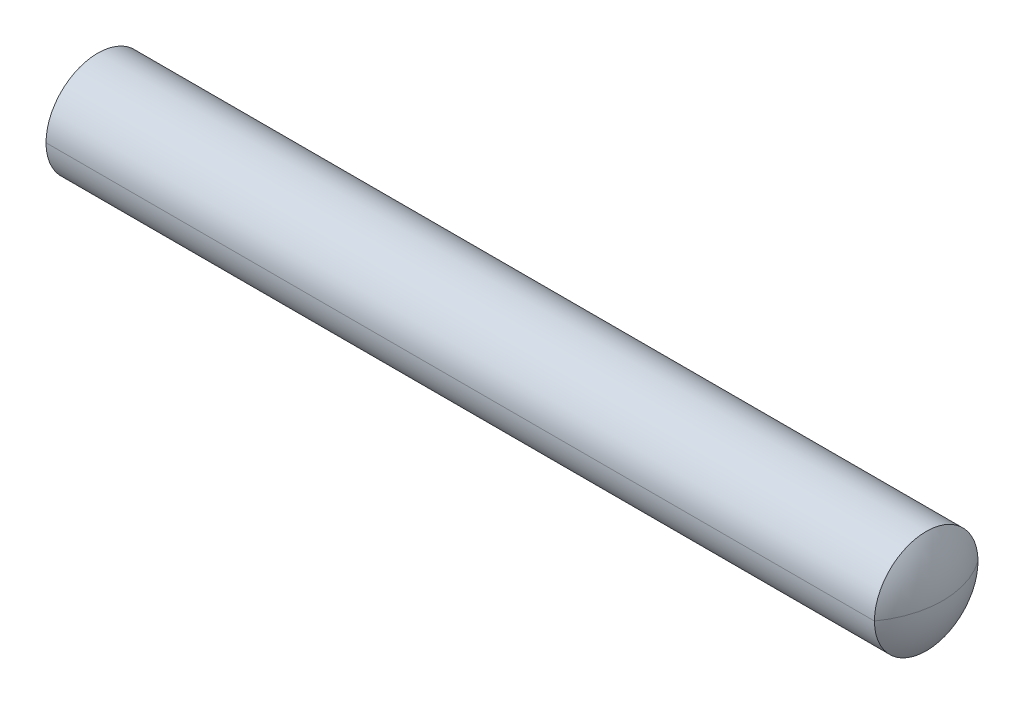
ISO-10303-21;
HEADER;
FILE_DESCRIPTION(('STEP AP214'),'2;1');
FILE_NAME('part.step','',(''),(''),'','','');
FILE_SCHEMA(('AUTOMOTIVE_DESIGN { 1 0 10303 214 1 1 1 1 }'));
ENDSEC;
DATA;
#1=APPLICATION_CONTEXT('core data for automotive mechanical design processes');
#2=APPLICATION_PROTOCOL_DEFINITION('international standard','automotive_design',2000,#1);
#3=PRODUCT_CONTEXT('',#1,'mechanical');
#4=PRODUCT('Part','Part','',(#3));
#5=PRODUCT_RELATED_PRODUCT_CATEGORY('part','',(#4));
#6=PRODUCT_DEFINITION_FORMATION('','',#4);
#7=PRODUCT_DEFINITION_CONTEXT('part definition',#1,'design');
#8=PRODUCT_DEFINITION('design','',#6,#7);
#9=PRODUCT_DEFINITION_SHAPE('','',#8);
#10=(LENGTH_UNIT() NAMED_UNIT(*) SI_UNIT(.MILLI.,.METRE.));
#11=(NAMED_UNIT(*) PLANE_ANGLE_UNIT() SI_UNIT($,.RADIAN.));
#12=(NAMED_UNIT(*) SI_UNIT($,.STERADIAN.) SOLID_ANGLE_UNIT());
#13=UNCERTAINTY_MEASURE_WITH_UNIT(LENGTH_MEASURE(1.E-05),#10,'distance_accuracy_value','');
#14=(GEOMETRIC_REPRESENTATION_CONTEXT(3) GLOBAL_UNCERTAINTY_ASSIGNED_CONTEXT((#13)) GLOBAL_UNIT_ASSIGNED_CONTEXT((#10,
#11,#12)) REPRESENTATION_CONTEXT('',''));
#15=CARTESIAN_POINT('',(0.,0.,0.));
#16=DIRECTION('',(0.,0.,1.));
#17=DIRECTION('',(1.,0.,0.));
#18=AXIS2_PLACEMENT_3D('',#15,#16,#17);
#19=CARTESIAN_POINT('',(10.4,0.,0.));
#20=DIRECTION('',(1.,0.,0.));
#21=DIRECTION('',(0.,0.,-1.));
#22=AXIS2_PLACEMENT_3D('',#19,#20,#21);
#23=CYLINDRICAL_SURFACE('',#22,1.25);
#24=CARTESIAN_POINT('',(0.4,0.,0.));
#25=DIRECTION('',(-1.,0.,0.));
#26=DIRECTION('',(0.,0.,1.));
#27=AXIS2_PLACEMENT_3D('',#24,#25,#26);
#28=CIRCLE('',#27,1.25);
#29=CARTESIAN_POINT('',(0.4,0.,1.25));
#30=VERTEX_POINT('',#29);
#31=CARTESIAN_POINT('',(0.4,0.,-1.25));
#32=VERTEX_POINT('',#31);
#33=EDGE_CURVE('E66',#30,#32,#28,.T.);
#34=ORIENTED_EDGE('',*,*,#33,.F.);
#35=DIRECTION('',(1.,0.,0.));
#36=VECTOR('',#35,1.);
#37=CARTESIAN_POINT('',(0.4,0.,1.25));
#38=LINE('',#37,#36);
#39=CARTESIAN_POINT('',(20.4,0.,1.25));
#40=VERTEX_POINT('',#39);
#41=EDGE_CURVE('E20',#30,#40,#38,.T.);
#42=ORIENTED_EDGE('',*,*,#41,.T.);
#43=CARTESIAN_POINT('',(20.4,0.,0.));
#44=DIRECTION('',(1.,0.,0.));
#45=DIRECTION('',(0.,0.,-1.));
#46=AXIS2_PLACEMENT_3D('',#43,#44,#45);
#47=CIRCLE('',#46,1.25);
#48=CARTESIAN_POINT('',(20.4,0.,-1.25));
#49=VERTEX_POINT('',#48);
#50=EDGE_CURVE('E70',#49,#40,#47,.T.);
#51=ORIENTED_EDGE('',*,*,#50,.F.);
#52=DIRECTION('',(-1.,0.,0.));
#53=VECTOR('',#52,1.);
#54=CARTESIAN_POINT('',(20.4,0.,-1.25));
#55=LINE('',#54,#53);
#56=EDGE_CURVE('E11',#49,#32,#55,.T.);
#57=ORIENTED_EDGE('',*,*,#56,.T.);
#58=EDGE_LOOP('',(#34,#42,#51,#57));
#59=FACE_BOUND('',#58,.T.);
#60=ADVANCED_FACE('F16',(#59),#23,.T.);
#61=CARTESIAN_POINT('',(10.4,0.,0.));
#62=DIRECTION('',(1.,0.,0.));
#63=DIRECTION('',(0.,0.,-1.));
#64=AXIS2_PLACEMENT_3D('',#61,#62,#63);
#65=CYLINDRICAL_SURFACE('',#64,1.25);
#66=CARTESIAN_POINT('',(20.4,0.,0.));
#67=DIRECTION('',(1.,0.,0.));
#68=DIRECTION('',(0.,0.,1.));
#69=AXIS2_PLACEMENT_3D('',#66,#67,#68);
#70=CIRCLE('',#69,1.25);
#71=EDGE_CURVE('E56',#40,#49,#70,.T.);
#72=ORIENTED_EDGE('',*,*,#71,.F.);
#73=ORIENTED_EDGE('',*,*,#41,.F.);
#74=CARTESIAN_POINT('',(0.4,0.,0.));
#75=DIRECTION('',(-1.,0.,0.));
#76=DIRECTION('',(0.,0.,-1.));
#77=AXIS2_PLACEMENT_3D('',#74,#75,#76);
#78=CIRCLE('',#77,1.25);
#79=EDGE_CURVE('E58',#32,#30,#78,.T.);
#80=ORIENTED_EDGE('',*,*,#79,.F.);
#81=ORIENTED_EDGE('',*,*,#56,.F.);
#82=EDGE_LOOP('',(#72,#73,#80,#81));
#83=FACE_BOUND('',#82,.T.);
#84=ADVANCED_FACE('F18',(#83),#65,.T.);
#85=CARTESIAN_POINT('',(2.153125,0.,0.));
#86=DIRECTION('',(0.,1.,0.));
#87=DIRECTION('',(-0.580551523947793,0.,0.81422351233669));
#88=AXIS2_PLACEMENT_3D('',#85,#86,#87);
#89=SPHERICAL_SURFACE('',#88,2.153125);
#90=ORIENTED_EDGE('',*,*,#79,.T.);
#91=CARTESIAN_POINT('',(2.153125,0.,0.));
#92=DIRECTION('',(0.,1.,0.));
#93=DIRECTION('',(-0.81422351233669,0.,-0.580551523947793));
#94=AXIS2_PLACEMENT_3D('',#91,#92,#93);
#95=CIRCLE('',#94,2.153125);
#96=EDGE_CURVE('E79',#32,#30,#95,.T.);
#97=ORIENTED_EDGE('',*,*,#96,.F.);
#98=EDGE_LOOP('',(#90,#97));
#99=FACE_BOUND('',#98,.T.);
#100=ADVANCED_FACE('F93',(#99),#89,.T.);
#101=CARTESIAN_POINT('',(2.153125,0.,0.));
#102=DIRECTION('',(0.,1.,0.));
#103=DIRECTION('',(1.,0.,0.));
#104=AXIS2_PLACEMENT_3D('',#101,#102,#103);
#105=SPHERICAL_SURFACE('',#104,2.153125);
#106=ORIENTED_EDGE('',*,*,#33,.T.);
#107=ORIENTED_EDGE('',*,*,#96,.T.);
#108=EDGE_LOOP('',(#106,#107));
#109=FACE_BOUND('',#108,.T.);
#110=ADVANCED_FACE('F92',(#109),#105,.T.);
#111=CARTESIAN_POINT('',(18.646875,0.,0.));
#112=DIRECTION('',(0.,1.,0.));
#113=DIRECTION('',(0.580551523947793,0.,-0.81422351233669));
#114=AXIS2_PLACEMENT_3D('',#111,#112,#113);
#115=SPHERICAL_SURFACE('',#114,2.153125);
#116=ORIENTED_EDGE('',*,*,#71,.T.);
#117=CARTESIAN_POINT('',(18.646875,0.,0.));
#118=DIRECTION('',(0.,1.,0.));
#119=DIRECTION('',(0.81422351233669,0.,0.580551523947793));
#120=AXIS2_PLACEMENT_3D('',#117,#118,#119);
#121=CIRCLE('',#120,2.153125);
#122=EDGE_CURVE('E63',#40,#49,#121,.T.);
#123=ORIENTED_EDGE('',*,*,#122,.F.);
#124=EDGE_LOOP('',(#116,#123));
#125=FACE_BOUND('',#124,.T.);
#126=ADVANCED_FACE('F62',(#125),#115,.T.);
#127=CARTESIAN_POINT('',(18.646875,0.,0.));
#128=DIRECTION('',(0.,1.,0.));
#129=DIRECTION('',(-1.,0.,0.));
#130=AXIS2_PLACEMENT_3D('',#127,#128,#129);
#131=SPHERICAL_SURFACE('',#130,2.153125);
#132=ORIENTED_EDGE('',*,*,#50,.T.);
#133=ORIENTED_EDGE('',*,*,#122,.T.);
#134=EDGE_LOOP('',(#132,#133));
#135=FACE_BOUND('',#134,.T.);
#136=ADVANCED_FACE('F69',(#135),#131,.T.);
#137=CLOSED_SHELL('',(#60,#84,#100,#110,#126,#136));
#138=MANIFOLD_SOLID_BREP('B1',#137);
#139=ADVANCED_BREP_SHAPE_REPRESENTATION('',(#18,#138),#14);
#140=SHAPE_DEFINITION_REPRESENTATION(#9,#139);
ENDSEC;
END-ISO-10303-21;
